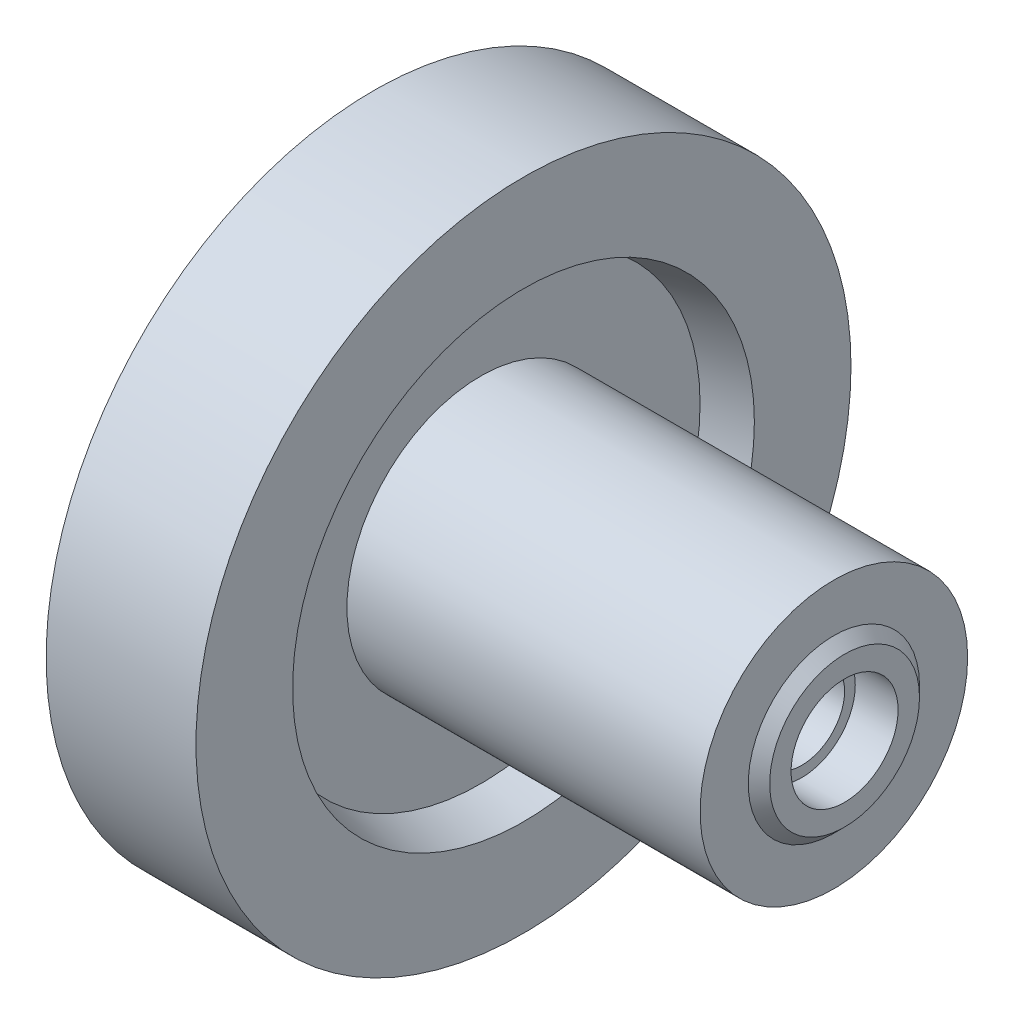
ISO-10303-21;
HEADER;
FILE_DESCRIPTION(('STEP AP214'),'2;1');
FILE_NAME('part.step','',(''),(''),'','','');
FILE_SCHEMA(('AUTOMOTIVE_DESIGN { 1 0 10303 214 1 1 1 1 }'));
ENDSEC;
DATA;
#1=APPLICATION_CONTEXT('core data for automotive mechanical design processes');
#2=APPLICATION_PROTOCOL_DEFINITION('international standard','automotive_design',2000,#1);
#3=PRODUCT_CONTEXT('',#1,'mechanical');
#4=PRODUCT('Part','Part','',(#3));
#5=PRODUCT_RELATED_PRODUCT_CATEGORY('part','',(#4));
#6=PRODUCT_DEFINITION_FORMATION('','',#4);
#7=PRODUCT_DEFINITION_CONTEXT('part definition',#1,'design');
#8=PRODUCT_DEFINITION('design','',#6,#7);
#9=PRODUCT_DEFINITION_SHAPE('','',#8);
#10=(LENGTH_UNIT() NAMED_UNIT(*) SI_UNIT(.MILLI.,.METRE.));
#11=(NAMED_UNIT(*) PLANE_ANGLE_UNIT() SI_UNIT($,.RADIAN.));
#12=(NAMED_UNIT(*) SI_UNIT($,.STERADIAN.) SOLID_ANGLE_UNIT());
#13=UNCERTAINTY_MEASURE_WITH_UNIT(LENGTH_MEASURE(1.E-05),#10,'distance_accuracy_value','');
#14=(GEOMETRIC_REPRESENTATION_CONTEXT(3) GLOBAL_UNCERTAINTY_ASSIGNED_CONTEXT((#13)) GLOBAL_UNIT_ASSIGNED_CONTEXT((#10,
#11,#12)) REPRESENTATION_CONTEXT('',''));
#15=CARTESIAN_POINT('',(0.,0.,0.));
#16=DIRECTION('',(0.,0.,1.));
#17=DIRECTION('',(1.,0.,0.));
#18=AXIS2_PLACEMENT_3D('',#15,#16,#17);
#19=CARTESIAN_POINT('',(-50.2,1.99999999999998,0.));
#20=DIRECTION('',(1.,0.,0.));
#21=DIRECTION('',(0.,0.,-1.));
#22=AXIS2_PLACEMENT_3D('',#19,#20,#21);
#23=PLANE('',#22);
#24=CARTESIAN_POINT('',(-50.2,0.,0.));
#25=DIRECTION('',(1.,0.,0.));
#26=DIRECTION('',(0.,0.,-1.));
#27=AXIS2_PLACEMENT_3D('',#24,#25,#26);
#28=CIRCLE('',#27,2.49999999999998);
#29=CARTESIAN_POINT('',(-50.2,0.,-2.49999999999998));
#30=VERTEX_POINT('',#29);
#31=EDGE_CURVE('E10',#30,#30,#28,.T.);
#32=ORIENTED_EDGE('',*,*,#31,.T.);
#33=EDGE_LOOP('',(#32));
#34=FACE_BOUND('',#33,.T.);
#35=CARTESIAN_POINT('',(-50.2,0.,0.));
#36=DIRECTION('',(1.,0.,0.));
#37=DIRECTION('',(0.,0.,-1.));
#38=AXIS2_PLACEMENT_3D('',#35,#36,#37);
#39=CIRCLE('',#38,1.99999999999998);
#40=CARTESIAN_POINT('',(-50.2,0.,-1.99999999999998));
#41=VERTEX_POINT('',#40);
#42=EDGE_CURVE('E79',#41,#41,#39,.T.);
#43=ORIENTED_EDGE('',*,*,#42,.F.);
#44=EDGE_LOOP('',(#43));
#45=FACE_BOUND('',#44,.T.);
#46=ADVANCED_FACE('F27',(#34,#45),#23,.T.);
#47=CARTESIAN_POINT('',(-19.6687128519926,0.,0.));
#48=DIRECTION('',(1.,0.,0.));
#49=DIRECTION('',(0.,0.,-1.));
#50=AXIS2_PLACEMENT_3D('',#47,#48,#49);
#51=CYLINDRICAL_SURFACE('',#50,2.49999999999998);
#52=CARTESIAN_POINT('',(-48.2,0.,0.));
#53=DIRECTION('',(1.,0.,0.));
#54=DIRECTION('',(0.,0.,-1.));
#55=AXIS2_PLACEMENT_3D('',#52,#53,#54);
#56=CIRCLE('',#55,2.49999999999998);
#57=CARTESIAN_POINT('',(-48.2,0.,-2.49999999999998));
#58=VERTEX_POINT('',#57);
#59=EDGE_CURVE('E33',#58,#58,#56,.T.);
#60=ORIENTED_EDGE('',*,*,#59,.T.);
#61=EDGE_LOOP('',(#60));
#62=FACE_BOUND('',#61,.T.);
#63=ORIENTED_EDGE('',*,*,#31,.F.);
#64=EDGE_LOOP('',(#63));
#65=FACE_BOUND('',#64,.T.);
#66=ADVANCED_FACE('F87',(#62,#65),#51,.F.);
#67=CARTESIAN_POINT('',(-48.2,2.49999999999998,0.));
#68=DIRECTION('',(1.,0.,0.));
#69=DIRECTION('',(0.,0.,-1.));
#70=AXIS2_PLACEMENT_3D('',#67,#68,#69);
#71=PLANE('',#70);
#72=CARTESIAN_POINT('',(-48.2,0.,0.));
#73=DIRECTION('',(1.,0.,0.));
#74=DIRECTION('',(0.,0.,-1.));
#75=AXIS2_PLACEMENT_3D('',#72,#73,#74);
#76=CIRCLE('',#75,3.49999999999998);
#77=CARTESIAN_POINT('',(-48.2,0.,-3.49999999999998));
#78=VERTEX_POINT('',#77);
#79=EDGE_CURVE('E37',#78,#78,#76,.T.);
#80=ORIENTED_EDGE('',*,*,#79,.T.);
#81=EDGE_LOOP('',(#80));
#82=FACE_BOUND('',#81,.T.);
#83=ORIENTED_EDGE('',*,*,#59,.F.);
#84=EDGE_LOOP('',(#83));
#85=FACE_BOUND('',#84,.T.);
#86=ADVANCED_FACE('F91',(#82,#85),#71,.T.);
#87=CARTESIAN_POINT('',(-48.2,0.,0.));
#88=DIRECTION('',(-1.,0.,0.));
#89=DIRECTION('',(0.,0.,1.));
#90=AXIS2_PLACEMENT_3D('',#87,#88,#89);
#91=CONICAL_SURFACE('',#90,3.49999999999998,0.785398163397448);
#92=CARTESIAN_POINT('',(-48.6999244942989,0.,0.));
#93=DIRECTION('',(1.,0.,0.));
#94=DIRECTION('',(0.,0.,-1.));
#95=AXIS2_PLACEMENT_3D('',#92,#93,#94);
#96=CIRCLE('',#95,3.99992449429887);
#97=CARTESIAN_POINT('',(-48.6999244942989,0.,-3.99992449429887));
#98=VERTEX_POINT('',#97);
#99=EDGE_CURVE('E41',#98,#98,#96,.T.);
#100=ORIENTED_EDGE('',*,*,#99,.T.);
#101=EDGE_LOOP('',(#100));
#102=FACE_BOUND('',#101,.T.);
#103=ORIENTED_EDGE('',*,*,#79,.F.);
#104=EDGE_LOOP('',(#103));
#105=FACE_BOUND('',#104,.T.);
#106=ADVANCED_FACE('F95',(#102,#105),#91,.T.);
#107=CARTESIAN_POINT('',(-48.6999244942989,3.99992449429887,0.));
#108=DIRECTION('',(1.,0.,0.));
#109=DIRECTION('',(0.,0.,-1.));
#110=AXIS2_PLACEMENT_3D('',#107,#108,#109);
#111=PLANE('',#110);
#112=CARTESIAN_POINT('',(-48.6999244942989,0.,0.));
#113=DIRECTION('',(1.,0.,0.));
#114=DIRECTION('',(0.,0.,-1.));
#115=AXIS2_PLACEMENT_3D('',#112,#113,#114);
#116=CIRCLE('',#115,6.25);
#117=CARTESIAN_POINT('',(-48.6999244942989,0.,-6.25));
#118=VERTEX_POINT('',#117);
#119=EDGE_CURVE('E46',#118,#118,#116,.T.);
#120=ORIENTED_EDGE('',*,*,#119,.T.);
#121=EDGE_LOOP('',(#120));
#122=FACE_BOUND('',#121,.T.);
#123=ORIENTED_EDGE('',*,*,#99,.F.);
#124=EDGE_LOOP('',(#123));
#125=FACE_BOUND('',#124,.T.);
#126=ADVANCED_FACE('F102',(#122,#125),#111,.T.);
#127=CARTESIAN_POINT('',(-19.6687128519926,0.,0.));
#128=DIRECTION('',(1.,0.,0.));
#129=DIRECTION('',(0.,0.,-1.));
#130=AXIS2_PLACEMENT_3D('',#127,#128,#129);
#131=CYLINDRICAL_SURFACE('',#130,6.25);
#132=CARTESIAN_POINT('',(-65.1999244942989,0.,0.));
#133=DIRECTION('',(1.,0.,0.));
#134=DIRECTION('',(0.,0.,-1.));
#135=AXIS2_PLACEMENT_3D('',#132,#133,#134);
#136=CIRCLE('',#135,6.25);
#137=CARTESIAN_POINT('',(-65.1999244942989,0.,-6.25));
#138=VERTEX_POINT('',#137);
#139=EDGE_CURVE('E49',#138,#138,#136,.T.);
#140=ORIENTED_EDGE('',*,*,#139,.T.);
#141=EDGE_LOOP('',(#140));
#142=FACE_BOUND('',#141,.T.);
#143=ORIENTED_EDGE('',*,*,#119,.F.);
#144=EDGE_LOOP('',(#143));
#145=FACE_BOUND('',#144,.T.);
#146=ADVANCED_FACE('F106',(#142,#145),#131,.T.);
#147=CARTESIAN_POINT('',(-65.1999244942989,6.25,0.));
#148=DIRECTION('',(1.,0.,0.));
#149=DIRECTION('',(0.,0.,-1.));
#150=AXIS2_PLACEMENT_3D('',#147,#148,#149);
#151=PLANE('',#150);
#152=CARTESIAN_POINT('',(-65.1999244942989,0.,0.));
#153=DIRECTION('',(1.,0.,0.));
#154=DIRECTION('',(0.,0.,-1.));
#155=AXIS2_PLACEMENT_3D('',#152,#153,#154);
#156=CIRCLE('',#155,10.25);
#157=CARTESIAN_POINT('',(-65.1999244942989,0.,-10.25));
#158=VERTEX_POINT('',#157);
#159=EDGE_CURVE('E52',#158,#158,#156,.T.);
#160=ORIENTED_EDGE('',*,*,#159,.T.);
#161=EDGE_LOOP('',(#160));
#162=FACE_BOUND('',#161,.T.);
#163=ORIENTED_EDGE('',*,*,#139,.F.);
#164=EDGE_LOOP('',(#163));
#165=FACE_BOUND('',#164,.T.);
#166=ADVANCED_FACE('F110',(#162,#165),#151,.T.);
#167=CARTESIAN_POINT('',(-65.1999244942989,0.,0.));
#168=DIRECTION('',(1.,0.,0.));
#169=DIRECTION('',(0.,0.,-1.));
#170=AXIS2_PLACEMENT_3D('',#167,#168,#169);
#171=CONICAL_SURFACE('',#170,10.25,0.261799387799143);
#172=CARTESIAN_POINT('',(-63.1999244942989,0.,0.));
#173=DIRECTION('',(1.,0.,0.));
#174=DIRECTION('',(0.,0.,-1.));
#175=AXIS2_PLACEMENT_3D('',#172,#173,#174);
#176=CIRCLE('',#175,10.7858983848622);
#177=CARTESIAN_POINT('',(-63.1999244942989,0.,-10.7858983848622));
#178=VERTEX_POINT('',#177);
#179=EDGE_CURVE('E55',#178,#178,#176,.T.);
#180=ORIENTED_EDGE('',*,*,#179,.T.);
#181=EDGE_LOOP('',(#180));
#182=FACE_BOUND('',#181,.T.);
#183=ORIENTED_EDGE('',*,*,#159,.F.);
#184=EDGE_LOOP('',(#183));
#185=FACE_BOUND('',#184,.T.);
#186=ADVANCED_FACE('F114',(#182,#185),#171,.F.);
#187=CARTESIAN_POINT('',(-63.1999244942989,10.7858983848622,0.));
#188=DIRECTION('',(1.,0.,0.));
#189=DIRECTION('',(0.,0.,-1.));
#190=AXIS2_PLACEMENT_3D('',#187,#188,#189);
#191=PLANE('',#190);
#192=CARTESIAN_POINT('',(-63.1999244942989,0.,0.));
#193=DIRECTION('',(1.,0.,0.));
#194=DIRECTION('',(0.,0.,-1.));
#195=AXIS2_PLACEMENT_3D('',#192,#193,#194);
#196=CIRCLE('',#195,15.3);
#197=CARTESIAN_POINT('',(-63.1999244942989,0.,-15.3));
#198=VERTEX_POINT('',#197);
#199=EDGE_CURVE('E58',#198,#198,#196,.T.);
#200=ORIENTED_EDGE('',*,*,#199,.T.);
#201=EDGE_LOOP('',(#200));
#202=FACE_BOUND('',#201,.T.);
#203=ORIENTED_EDGE('',*,*,#179,.F.);
#204=EDGE_LOOP('',(#203));
#205=FACE_BOUND('',#204,.T.);
#206=ADVANCED_FACE('F118',(#202,#205),#191,.T.);
#207=CARTESIAN_POINT('',(-19.6687128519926,0.,0.));
#208=DIRECTION('',(1.,0.,0.));
#209=DIRECTION('',(0.,0.,-1.));
#210=AXIS2_PLACEMENT_3D('',#207,#208,#209);
#211=CYLINDRICAL_SURFACE('',#210,15.3);
#212=CARTESIAN_POINT('',(-70.1999244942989,0.,0.));
#213=DIRECTION('',(1.,0.,0.));
#214=DIRECTION('',(0.,0.,-1.));
#215=AXIS2_PLACEMENT_3D('',#212,#213,#214);
#216=CIRCLE('',#215,15.3);
#217=CARTESIAN_POINT('',(-70.1999244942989,0.,-15.3));
#218=VERTEX_POINT('',#217);
#219=EDGE_CURVE('E61',#218,#218,#216,.T.);
#220=ORIENTED_EDGE('',*,*,#219,.T.);
#221=EDGE_LOOP('',(#220));
#222=FACE_BOUND('',#221,.T.);
#223=ORIENTED_EDGE('',*,*,#199,.F.);
#224=EDGE_LOOP('',(#223));
#225=FACE_BOUND('',#224,.T.);
#226=ADVANCED_FACE('F122',(#222,#225),#211,.T.);
#227=CARTESIAN_POINT('',(-70.1999244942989,15.3,0.));
#228=DIRECTION('',(-1.,0.,0.));
#229=DIRECTION('',(0.,0.,1.));
#230=AXIS2_PLACEMENT_3D('',#227,#228,#229);
#231=PLANE('',#230);
#232=CARTESIAN_POINT('',(-70.1999244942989,0.,0.));
#233=DIRECTION('',(1.,0.,0.));
#234=DIRECTION('',(0.,0.,-1.));
#235=AXIS2_PLACEMENT_3D('',#232,#233,#234);
#236=CIRCLE('',#235,10.7858983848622);
#237=CARTESIAN_POINT('',(-70.1999244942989,0.,-10.7858983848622));
#238=VERTEX_POINT('',#237);
#239=EDGE_CURVE('E64',#238,#238,#236,.T.);
#240=ORIENTED_EDGE('',*,*,#239,.T.);
#241=EDGE_LOOP('',(#240));
#242=FACE_BOUND('',#241,.T.);
#243=ORIENTED_EDGE('',*,*,#219,.F.);
#244=EDGE_LOOP('',(#243));
#245=FACE_BOUND('',#244,.T.);
#246=ADVANCED_FACE('F126',(#242,#245),#231,.T.);
#247=CARTESIAN_POINT('',(-70.1999244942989,0.,0.));
#248=DIRECTION('',(-1.,0.,0.));
#249=DIRECTION('',(0.,0.,1.));
#250=AXIS2_PLACEMENT_3D('',#247,#248,#249);
#251=CONICAL_SURFACE('',#250,10.7858983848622,0.261799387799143);
#252=CARTESIAN_POINT('',(-68.1999244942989,0.,0.));
#253=DIRECTION('',(1.,0.,0.));
#254=DIRECTION('',(0.,0.,-1.));
#255=AXIS2_PLACEMENT_3D('',#252,#253,#254);
#256=CIRCLE('',#255,10.25);
#257=CARTESIAN_POINT('',(-68.1999244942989,0.,-10.25));
#258=VERTEX_POINT('',#257);
#259=EDGE_CURVE('E67',#258,#258,#256,.T.);
#260=ORIENTED_EDGE('',*,*,#259,.T.);
#261=EDGE_LOOP('',(#260));
#262=FACE_BOUND('',#261,.T.);
#263=ORIENTED_EDGE('',*,*,#239,.F.);
#264=EDGE_LOOP('',(#263));
#265=FACE_BOUND('',#264,.T.);
#266=ADVANCED_FACE('F130',(#262,#265),#251,.F.);
#267=CARTESIAN_POINT('',(-68.1999244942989,10.25,0.));
#268=DIRECTION('',(-1.,0.,0.));
#269=DIRECTION('',(0.,0.,1.));
#270=AXIS2_PLACEMENT_3D('',#267,#268,#269);
#271=PLANE('',#270);
#272=CARTESIAN_POINT('',(-68.1999244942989,0.,0.));
#273=DIRECTION('',(1.,0.,0.));
#274=DIRECTION('',(0.,0.,-1.));
#275=AXIS2_PLACEMENT_3D('',#272,#273,#274);
#276=CIRCLE('',#275,3.37999999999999);
#277=CARTESIAN_POINT('',(-68.1999244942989,0.,-3.37999999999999));
#278=VERTEX_POINT('',#277);
#279=EDGE_CURVE('E70',#278,#278,#276,.T.);
#280=ORIENTED_EDGE('',*,*,#279,.T.);
#281=EDGE_LOOP('',(#280));
#282=FACE_BOUND('',#281,.T.);
#283=ORIENTED_EDGE('',*,*,#259,.F.);
#284=EDGE_LOOP('',(#283));
#285=FACE_BOUND('',#284,.T.);
#286=ADVANCED_FACE('F134',(#282,#285),#271,.T.);
#287=CARTESIAN_POINT('',(-19.6687128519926,0.,0.));
#288=DIRECTION('',(1.,0.,0.));
#289=DIRECTION('',(0.,0.,-1.));
#290=AXIS2_PLACEMENT_3D('',#287,#288,#289);
#291=CYLINDRICAL_SURFACE('',#290,3.37999999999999);
#292=CARTESIAN_POINT('',(-70.,0.,0.));
#293=DIRECTION('',(1.,0.,0.));
#294=DIRECTION('',(0.,0.,-1.));
#295=AXIS2_PLACEMENT_3D('',#292,#293,#294);
#296=CIRCLE('',#295,3.37999999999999);
#297=CARTESIAN_POINT('',(-70.,0.,-3.37999999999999));
#298=VERTEX_POINT('',#297);
#299=EDGE_CURVE('E73',#298,#298,#296,.T.);
#300=ORIENTED_EDGE('',*,*,#299,.T.);
#301=EDGE_LOOP('',(#300));
#302=FACE_BOUND('',#301,.T.);
#303=ORIENTED_EDGE('',*,*,#279,.F.);
#304=EDGE_LOOP('',(#303));
#305=FACE_BOUND('',#304,.T.);
#306=ADVANCED_FACE('F138',(#302,#305),#291,.T.);
#307=CARTESIAN_POINT('',(-70.,3.37999999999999,0.));
#308=DIRECTION('',(-1.,0.,0.));
#309=DIRECTION('',(0.,0.,1.));
#310=AXIS2_PLACEMENT_3D('',#307,#308,#309);
#311=PLANE('',#310);
#312=CARTESIAN_POINT('',(-70.,0.,0.));
#313=DIRECTION('',(1.,0.,0.));
#314=DIRECTION('',(0.,0.,-1.));
#315=AXIS2_PLACEMENT_3D('',#312,#313,#314);
#316=CIRCLE('',#315,1.99999999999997);
#317=CARTESIAN_POINT('',(-70.,0.,-1.99999999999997));
#318=VERTEX_POINT('',#317);
#319=EDGE_CURVE('E76',#318,#318,#316,.T.);
#320=ORIENTED_EDGE('',*,*,#319,.T.);
#321=EDGE_LOOP('',(#320));
#322=FACE_BOUND('',#321,.T.);
#323=ORIENTED_EDGE('',*,*,#299,.F.);
#324=EDGE_LOOP('',(#323));
#325=FACE_BOUND('',#324,.T.);
#326=ADVANCED_FACE('F142',(#322,#325),#311,.T.);
#327=CARTESIAN_POINT('',(-19.6687128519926,0.,0.));
#328=DIRECTION('',(1.,0.,0.));
#329=DIRECTION('',(0.,0.,-1.));
#330=AXIS2_PLACEMENT_3D('',#327,#328,#329);
#331=CYLINDRICAL_SURFACE('',#330,1.99999999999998);
#332=ORIENTED_EDGE('',*,*,#42,.T.);
#333=EDGE_LOOP('',(#332));
#334=FACE_BOUND('',#333,.T.);
#335=ORIENTED_EDGE('',*,*,#319,.F.);
#336=EDGE_LOOP('',(#335));
#337=FACE_BOUND('',#336,.T.);
#338=ADVANCED_FACE('F83',(#334,#337),#331,.F.);
#339=CLOSED_SHELL('',(#46,#66,#86,#106,#126,#146,#166,#186,#206,#226,#246,#266,#286,#306,#326,#338));
#340=MANIFOLD_SOLID_BREP('B2',#339);
#341=ADVANCED_BREP_SHAPE_REPRESENTATION('',(#18,#340),#14);
#342=SHAPE_DEFINITION_REPRESENTATION(#9,#341);
ENDSEC;
END-ISO-10303-21;
